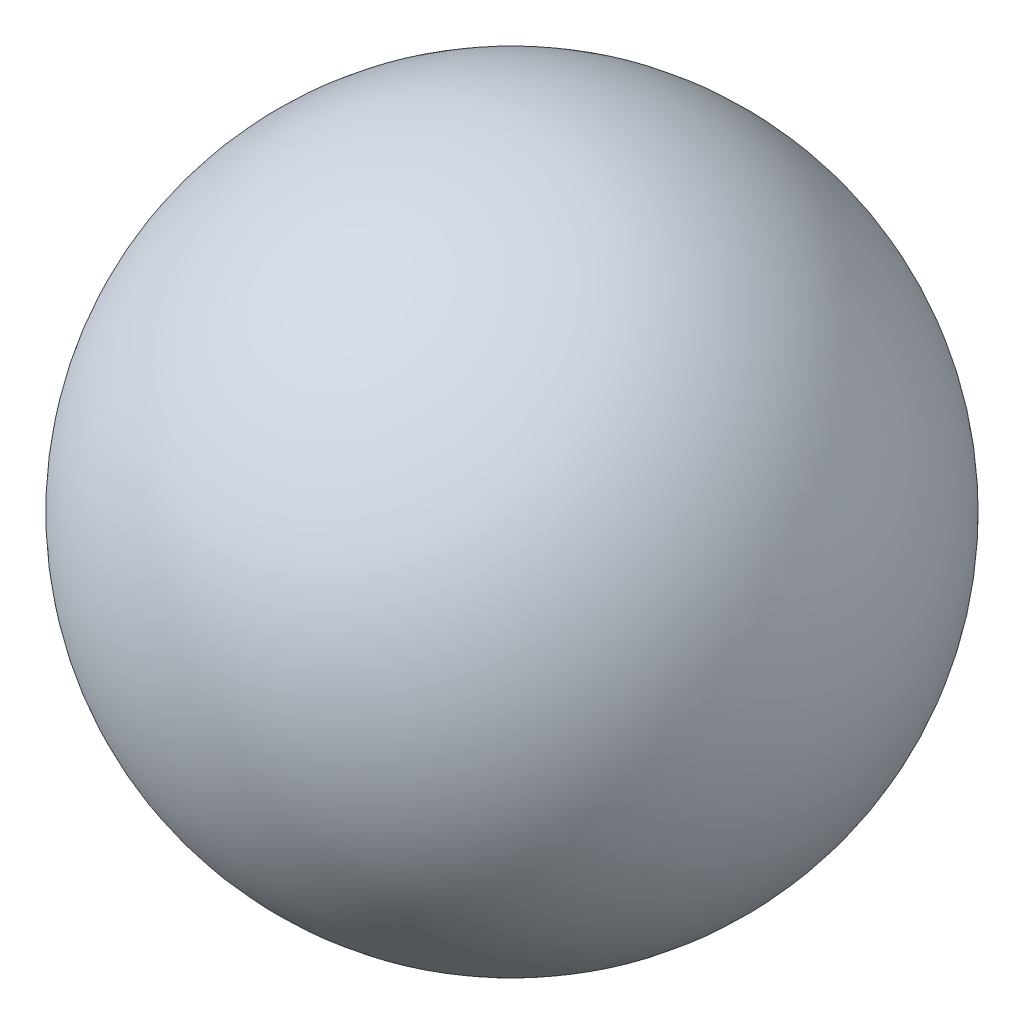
from build123d import *


with BuildPart() as part:
    # Esquisse1 → R_volution1 (revolve)
    with BuildSketch(Plane.XY):
        with BuildLine():
            Line((0, 10), (0, -10))
            ThreePointArc((0, -10), (10, 0), (0, 10))
        make_face()
    revolve(axis=Axis((0, 1.333479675, 0), (0, 1, 0)))


solid = part.part
